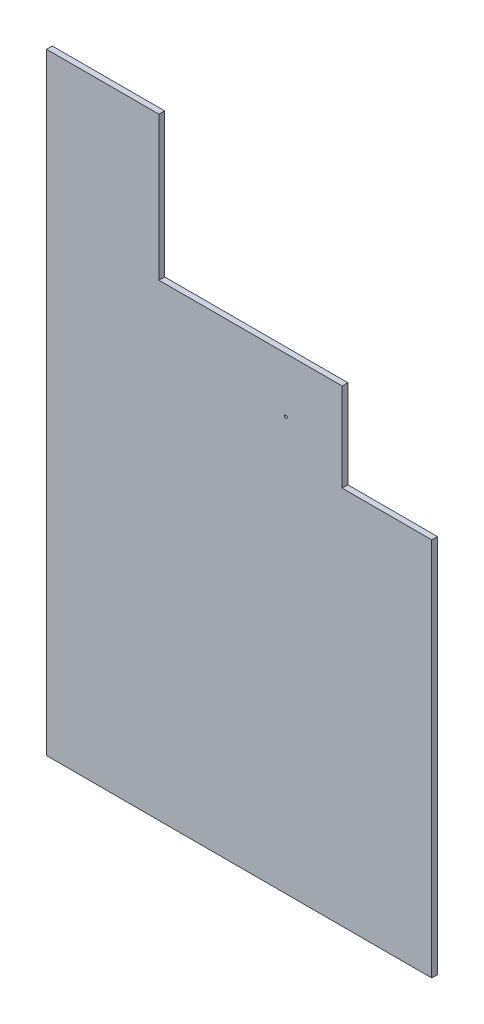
from build123d import *

# Parameters (mm, degrees)
ESQUISSE1_R      = 2.5
EXTRUSION1_DEPTH = 10


with BuildPart() as part:
    # Esquisse1 → Extrusion1 (new body)
    with BuildSketch(Plane.XY):
        Polygon((0, 0), (-675, 0), (-675, 1072), (-478, 1072), (-478, 820), (-157, 820), (-157, 665), (0, 665), align=None)
        with Locations((-255.5, 724)):
            Circle(ESQUISSE1_R, mode=Mode.SUBTRACT)
    extrude(amount=EXTRUSION1_DEPTH)


solid = part.part
